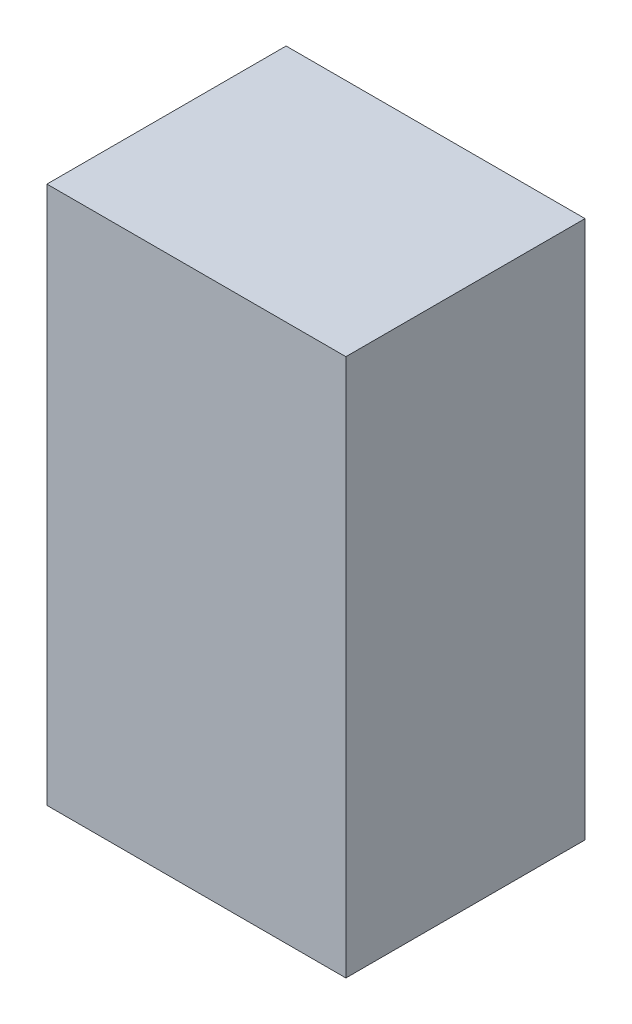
from build123d import *

# Parameters (mm, degrees)
SKIZZE1_W               = 25
SKIZZE1_H               = 45
LINEAR_AUSTRAGEN1_DEPTH = 20


with BuildPart() as part:
    # Skizze1 → Linear austragen1 (new body)
    with BuildSketch(Plane.XY):
        with Locations((12.5, -22.5)):
            Rectangle(SKIZZE1_W, SKIZZE1_H)
    extrude(amount=LINEAR_AUSTRAGEN1_DEPTH)


solid = part.part
